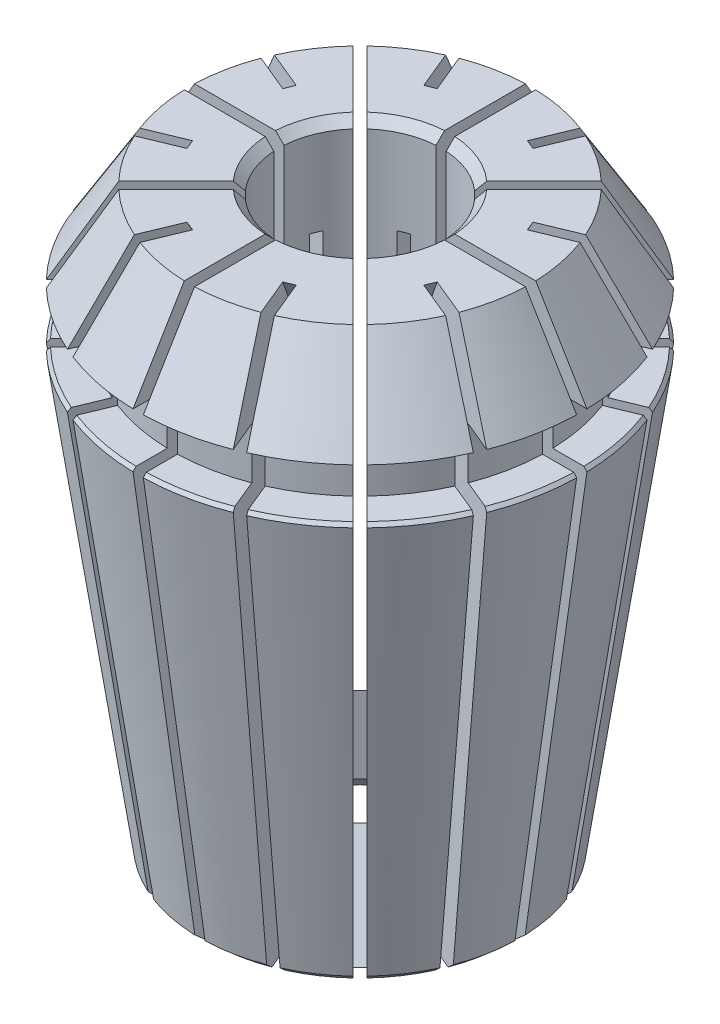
from build123d import *

# Parameters (mm, degrees)
CUT_EXTRUDE1_DEPTH = 0.3
CIRPATTERN1_COUNT  = 8
CUT_EXTRUDE2_DEPTH = 0.3
CIRPATTERN2_COUNT  = 8


with BuildPart() as part:
    # Sketch1 → Revolve1 (revolve)
    with BuildSketch(Plane.XY, mode=Mode.PRIVATE) as revolve1_sk:
        Polygon((5.2625, 34), (10, 34), (13, 29), (11, 29), (11, 26), (12.828284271, 26), (13, 25.802010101), (9.384709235, 0.494974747), (8.813998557, 0), (5.0625, 0), (4.7625, 0.5), (4.7625, 33.5), align=None)
    revolve(revolve1_sk.sketch.rotate(Axis((0, 0, 0), (0, 1, 0)), 90), axis=Axis((0, 0, 0), (0, 1, 0)))

    # Sketch2 → Cut-Extrude1 (cut, symmetric)
    with BuildSketch(Plane(origin=(0, 0, 0), x_dir=(0, 0, -1), z_dir=(1, 0, 0))):
        Polygon((0, 34), (0, 5), (4.7625, 5), (8.0625, 0), (11.232779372, -1.420953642), (15.468884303, 25.819616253), (15.468884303, 34), align=None)
    cut_extrude1 = extrude(amount=CUT_EXTRUDE1_DEPTH, both=True, mode=Mode.SUBTRACT)

    # CirPattern1: Cut-Extrude1 ×8 about axis
    cirpattern1_axis = Axis((0, 0, 0), (0, 1, 0))
    for i in range(1, CIRPATTERN1_COUNT):
        add(cut_extrude1.rotate(cirpattern1_axis, i * 360 / CIRPATTERN1_COUNT), mode=Mode.SUBTRACT)

    # Sketch4 → Cut-Extrude2 (cut, symmetric)
    with BuildSketch(Plane(origin=(0, 0, 0), x_dir=(0.9238795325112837, 0, 0.3826834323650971), z_dir=(-0.3826834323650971, 0, 0.9238795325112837))):
        Polygon((12.334597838, 36.276457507), (7.634271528, 34), (4.7625, 28.501644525), (0, 28.501644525), (0, -1.503304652), (12.334597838, -1.503304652), (14.749739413, 29.543043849), align=None)
    cut_extrude2 = extrude(amount=CUT_EXTRUDE2_DEPTH, both=True, mode=Mode.SUBTRACT)

    # CirPattern2: Cut-Extrude2 ×8 about axis
    cirpattern2_axis = Axis((0, 0, 0), (0, 1, 0))
    for i in range(1, CIRPATTERN2_COUNT):
        add(cut_extrude2.rotate(cirpattern2_axis, i * 360 / CIRPATTERN2_COUNT), mode=Mode.SUBTRACT)


solid = part.part
